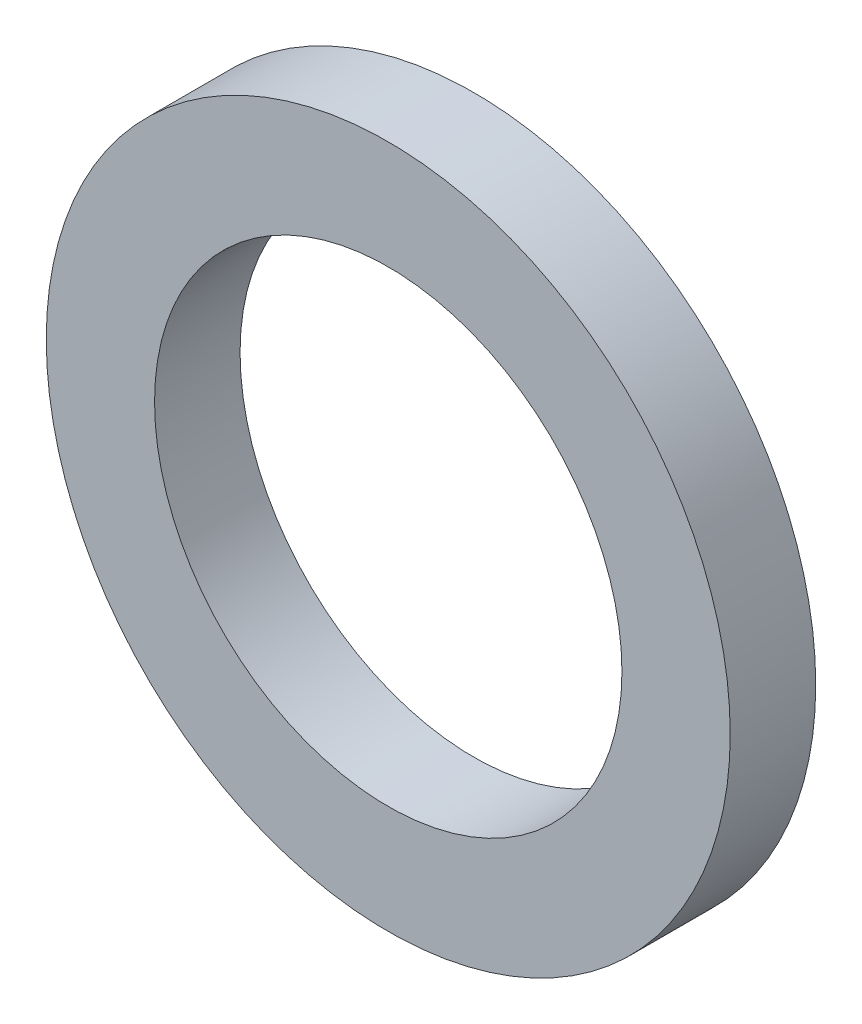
from build123d import *

# Parameters (mm, degrees)
ESQUISSE1_W = 1.5
ESQUISSE1_H = 1.9


with BuildPart() as part:
    # Esquisse1 → R_volution1 (revolve)
    with BuildSketch(Plane(origin=(0, 0, 0), x_dir=(0, 0, -1), z_dir=(1, 0, 0)), mode=Mode.PRIVATE) as r_volution1_sk:
        with Locations((0, 5.05)):
            Rectangle(ESQUISSE1_W, ESQUISSE1_H)
    revolve(r_volution1_sk.sketch.rotate(Axis((0, 0, 0), (0, 0, 1)), 90), axis=Axis((0, 0, 0), (0, 0, 1)))


solid = part.part
